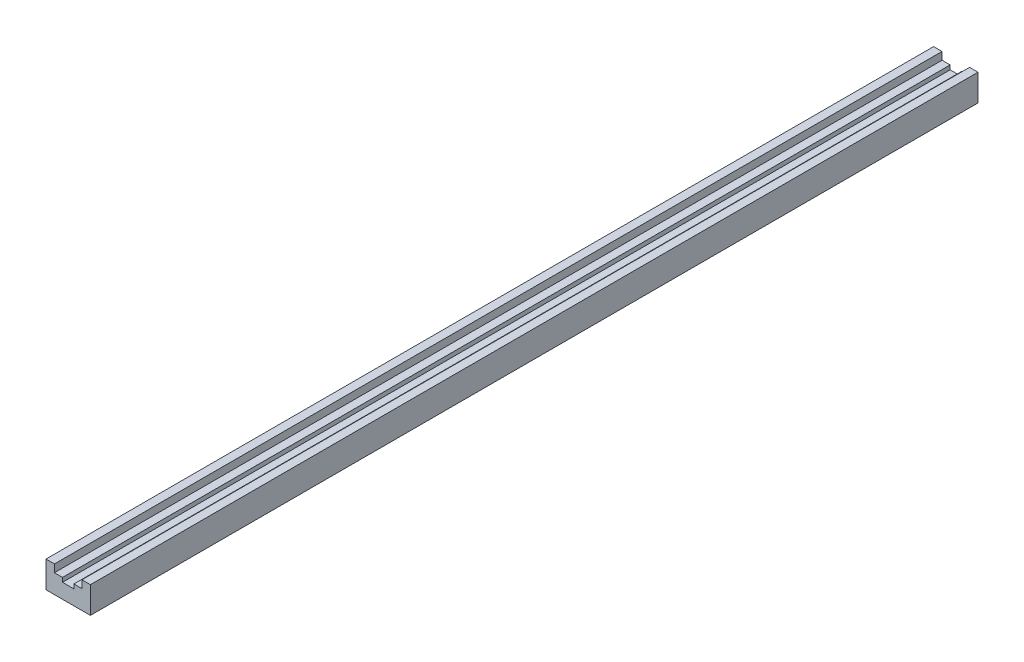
ISO-10303-21;
HEADER;
FILE_DESCRIPTION(('STEP AP214'),'2;1');
FILE_NAME('part.step','',(''),(''),'','','');
FILE_SCHEMA(('AUTOMOTIVE_DESIGN { 1 0 10303 214 1 1 1 1 }'));
ENDSEC;
DATA;
#1=APPLICATION_CONTEXT('core data for automotive mechanical design processes');
#2=APPLICATION_PROTOCOL_DEFINITION('international standard','automotive_design',2000,#1);
#3=PRODUCT_CONTEXT('',#1,'mechanical');
#4=PRODUCT('Part','Part','',(#3));
#5=PRODUCT_RELATED_PRODUCT_CATEGORY('part','',(#4));
#6=PRODUCT_DEFINITION_FORMATION('','',#4);
#7=PRODUCT_DEFINITION_CONTEXT('part definition',#1,'design');
#8=PRODUCT_DEFINITION('design','',#6,#7);
#9=PRODUCT_DEFINITION_SHAPE('','',#8);
#10=(LENGTH_UNIT() NAMED_UNIT(*) SI_UNIT(.MILLI.,.METRE.));
#11=(NAMED_UNIT(*) PLANE_ANGLE_UNIT() SI_UNIT($,.RADIAN.));
#12=(NAMED_UNIT(*) SI_UNIT($,.STERADIAN.) SOLID_ANGLE_UNIT());
#13=UNCERTAINTY_MEASURE_WITH_UNIT(LENGTH_MEASURE(1.E-05),#10,'distance_accuracy_value','');
#14=(GEOMETRIC_REPRESENTATION_CONTEXT(3) GLOBAL_UNCERTAINTY_ASSIGNED_CONTEXT((#13)) GLOBAL_UNIT_ASSIGNED_CONTEXT((#10,
#11,#12)) REPRESENTATION_CONTEXT('',''));
#15=CARTESIAN_POINT('',(0.,0.,0.));
#16=DIRECTION('',(0.,0.,1.));
#17=DIRECTION('',(1.,0.,0.));
#18=AXIS2_PLACEMENT_3D('',#15,#16,#17);
#19=CARTESIAN_POINT('',(-3.20000000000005,10.7,0.));
#20=DIRECTION('',(-1.,0.,0.));
#21=DIRECTION('',(0.,0.,1.));
#22=AXIS2_PLACEMENT_3D('',#19,#20,#21);
#23=PLANE('',#22);
#24=DIRECTION('',(0.,0.,1.));
#25=VECTOR('',#24,1.);
#26=CARTESIAN_POINT('',(-3.20000000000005,8.3,0.));
#27=LINE('',#26,#25);
#28=CARTESIAN_POINT('',(-3.20000000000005,8.3,0.));
#29=VERTEX_POINT('',#28);
#30=CARTESIAN_POINT('',(-3.20000000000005,8.3,500.));
#31=VERTEX_POINT('',#30);
#32=EDGE_CURVE('E9',#29,#31,#27,.T.);
#33=ORIENTED_EDGE('',*,*,#32,.F.);
#34=DIRECTION('',(0.,-1.,0.));
#35=VECTOR('',#34,1.);
#36=CARTESIAN_POINT('',(-3.20000000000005,10.7,0.));
#37=LINE('',#36,#35);
#38=CARTESIAN_POINT('',(-3.20000000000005,10.7,0.));
#39=VERTEX_POINT('',#38);
#40=EDGE_CURVE('E149',#39,#29,#37,.T.);
#41=ORIENTED_EDGE('',*,*,#40,.F.);
#42=DIRECTION('',(0.,0.,1.));
#43=VECTOR('',#42,1.);
#44=CARTESIAN_POINT('',(-3.20000000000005,10.7,0.));
#45=LINE('',#44,#43);
#46=CARTESIAN_POINT('',(-3.20000000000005,10.7,500.));
#47=VERTEX_POINT('',#46);
#48=EDGE_CURVE('E29',#39,#47,#45,.T.);
#49=ORIENTED_EDGE('',*,*,#48,.T.);
#50=DIRECTION('',(0.,-1.,0.));
#51=VECTOR('',#50,1.);
#52=CARTESIAN_POINT('',(-3.20000000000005,10.7,500.));
#53=LINE('',#52,#51);
#54=EDGE_CURVE('E113',#47,#31,#53,.T.);
#55=ORIENTED_EDGE('',*,*,#54,.T.);
#56=EDGE_LOOP('',(#33,#41,#49,#55));
#57=FACE_BOUND('',#56,.T.);
#58=ADVANCED_FACE('F14',(#57),#23,.F.);
#59=CARTESIAN_POINT('',(-3.20000000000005,8.3,0.));
#60=DIRECTION('',(0.,-1.,0.));
#61=DIRECTION('',(0.,0.,-1.));
#62=AXIS2_PLACEMENT_3D('',#59,#60,#61);
#63=PLANE('',#62);
#64=DIRECTION('',(0.,0.,1.));
#65=VECTOR('',#64,1.);
#66=CARTESIAN_POINT('',(3.19999999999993,8.3,0.));
#67=LINE('',#66,#65);
#68=CARTESIAN_POINT('',(3.19999999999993,8.3,0.));
#69=VERTEX_POINT('',#68);
#70=CARTESIAN_POINT('',(3.19999999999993,8.3,500.));
#71=VERTEX_POINT('',#70);
#72=EDGE_CURVE('E22',#69,#71,#67,.T.);
#73=ORIENTED_EDGE('',*,*,#72,.F.);
#74=DIRECTION('',(1.,0.,0.));
#75=VECTOR('',#74,1.);
#76=CARTESIAN_POINT('',(-3.20000000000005,8.3,0.));
#77=LINE('',#76,#75);
#78=EDGE_CURVE('E109',#29,#69,#77,.T.);
#79=ORIENTED_EDGE('',*,*,#78,.F.);
#80=ORIENTED_EDGE('',*,*,#32,.T.);
#81=DIRECTION('',(1.,0.,0.));
#82=VECTOR('',#81,1.);
#83=CARTESIAN_POINT('',(-3.20000000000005,8.3,500.));
#84=LINE('',#83,#82);
#85=EDGE_CURVE('E106',#31,#71,#84,.T.);
#86=ORIENTED_EDGE('',*,*,#85,.T.);
#87=EDGE_LOOP('',(#73,#79,#80,#86));
#88=FACE_BOUND('',#87,.T.);
#89=ADVANCED_FACE('F16',(#88),#63,.F.);
#90=CARTESIAN_POINT('',(3.20000000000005,10.7,0.));
#91=DIRECTION('',(-1.,0.,0.));
#92=DIRECTION('',(0.,-1.,0.));
#93=AXIS2_PLACEMENT_3D('',#90,#91,#92);
#94=PLANE('',#93);
#95=DIRECTION('',(0.,0.,1.));
#96=VECTOR('',#95,1.);
#97=CARTESIAN_POINT('',(3.20000000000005,10.7,0.));
#98=LINE('',#97,#96);
#99=CARTESIAN_POINT('',(3.20000000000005,10.7,0.));
#100=VERTEX_POINT('',#99);
#101=CARTESIAN_POINT('',(3.20000000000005,10.7,500.));
#102=VERTEX_POINT('',#101);
#103=EDGE_CURVE('E197',#100,#102,#98,.T.);
#104=ORIENTED_EDGE('',*,*,#103,.F.);
#105=DIRECTION('',(0.,-1.,0.));
#106=VECTOR('',#105,1.);
#107=CARTESIAN_POINT('',(3.20000000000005,10.7,0.));
#108=LINE('',#107,#106);
#109=EDGE_CURVE('E152',#100,#69,#108,.T.);
#110=ORIENTED_EDGE('',*,*,#109,.T.);
#111=ORIENTED_EDGE('',*,*,#72,.T.);
#112=DIRECTION('',(0.,-1.,0.));
#113=VECTOR('',#112,1.);
#114=CARTESIAN_POINT('',(3.20000000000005,10.7,500.));
#115=LINE('',#114,#113);
#116=EDGE_CURVE('E120',#102,#71,#115,.T.);
#117=ORIENTED_EDGE('',*,*,#116,.F.);
#118=EDGE_LOOP('',(#104,#110,#111,#117));
#119=FACE_BOUND('',#118,.T.);
#120=ADVANCED_FACE('F199',(#119),#94,.T.);
#121=CARTESIAN_POINT('',(3.20000000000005,10.7,0.));
#122=DIRECTION('',(0.,-1.,0.));
#123=DIRECTION('',(0.,0.,-1.));
#124=AXIS2_PLACEMENT_3D('',#121,#122,#123);
#125=PLANE('',#124);
#126=DIRECTION('',(0.,0.,1.));
#127=VECTOR('',#126,1.);
#128=CARTESIAN_POINT('',(7.75,10.7,0.));
#129=LINE('',#128,#127);
#130=CARTESIAN_POINT('',(7.75,10.7,0.));
#131=VERTEX_POINT('',#130);
#132=CARTESIAN_POINT('',(7.75,10.7,500.));
#133=VERTEX_POINT('',#132);
#134=EDGE_CURVE('E195',#131,#133,#129,.T.);
#135=ORIENTED_EDGE('',*,*,#134,.F.);
#136=DIRECTION('',(1.,0.,0.));
#137=VECTOR('',#136,1.);
#138=CARTESIAN_POINT('',(3.20000000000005,10.7,0.));
#139=LINE('',#138,#137);
#140=EDGE_CURVE('E155',#100,#131,#139,.T.);
#141=ORIENTED_EDGE('',*,*,#140,.F.);
#142=ORIENTED_EDGE('',*,*,#103,.T.);
#143=DIRECTION('',(1.,0.,0.));
#144=VECTOR('',#143,1.);
#145=CARTESIAN_POINT('',(3.20000000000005,10.7,500.));
#146=LINE('',#145,#144);
#147=EDGE_CURVE('E122',#102,#133,#146,.T.);
#148=ORIENTED_EDGE('',*,*,#147,.T.);
#149=EDGE_LOOP('',(#135,#141,#142,#148));
#150=FACE_BOUND('',#149,.T.);
#151=ADVANCED_FACE('F232',(#150),#125,.F.);
#152=CARTESIAN_POINT('',(7.75,15.,0.));
#153=DIRECTION('',(-1.,0.,0.));
#154=DIRECTION('',(0.,0.,1.));
#155=AXIS2_PLACEMENT_3D('',#152,#153,#154);
#156=PLANE('',#155);
#157=DIRECTION('',(0.,0.,1.));
#158=VECTOR('',#157,1.);
#159=CARTESIAN_POINT('',(7.75,15.,0.));
#160=LINE('',#159,#158);
#161=CARTESIAN_POINT('',(7.75,15.,0.));
#162=VERTEX_POINT('',#161);
#163=CARTESIAN_POINT('',(7.75,15.,500.));
#164=VERTEX_POINT('',#163);
#165=EDGE_CURVE('E193',#162,#164,#160,.T.);
#166=ORIENTED_EDGE('',*,*,#165,.F.);
#167=DIRECTION('',(0.,-1.,0.));
#168=VECTOR('',#167,1.);
#169=CARTESIAN_POINT('',(7.75,15.,0.));
#170=LINE('',#169,#168);
#171=EDGE_CURVE('E158',#162,#131,#170,.T.);
#172=ORIENTED_EDGE('',*,*,#171,.T.);
#173=ORIENTED_EDGE('',*,*,#134,.T.);
#174=DIRECTION('',(0.,-1.,0.));
#175=VECTOR('',#174,1.);
#176=CARTESIAN_POINT('',(7.75,15.,500.));
#177=LINE('',#176,#175);
#178=EDGE_CURVE('E127',#164,#133,#177,.T.);
#179=ORIENTED_EDGE('',*,*,#178,.F.);
#180=EDGE_LOOP('',(#166,#172,#173,#179));
#181=FACE_BOUND('',#180,.T.);
#182=ADVANCED_FACE('F230',(#181),#156,.T.);
#183=CARTESIAN_POINT('',(7.75,15.,0.));
#184=DIRECTION('',(0.,-1.,0.));
#185=DIRECTION('',(0.,0.,-1.));
#186=AXIS2_PLACEMENT_3D('',#183,#184,#185);
#187=PLANE('',#186);
#188=DIRECTION('',(0.,0.,1.));
#189=VECTOR('',#188,1.);
#190=CARTESIAN_POINT('',(12.5,15.,0.));
#191=LINE('',#190,#189);
#192=CARTESIAN_POINT('',(12.5,15.,0.));
#193=VERTEX_POINT('',#192);
#194=CARTESIAN_POINT('',(12.5,15.,500.));
#195=VERTEX_POINT('',#194);
#196=EDGE_CURVE('E191',#193,#195,#191,.T.);
#197=ORIENTED_EDGE('',*,*,#196,.F.);
#198=DIRECTION('',(1.,0.,0.));
#199=VECTOR('',#198,1.);
#200=CARTESIAN_POINT('',(7.75,15.,0.));
#201=LINE('',#200,#199);
#202=EDGE_CURVE('E161',#162,#193,#201,.T.);
#203=ORIENTED_EDGE('',*,*,#202,.F.);
#204=ORIENTED_EDGE('',*,*,#165,.T.);
#205=DIRECTION('',(1.,0.,0.));
#206=VECTOR('',#205,1.);
#207=CARTESIAN_POINT('',(7.75,15.,500.));
#208=LINE('',#207,#206);
#209=EDGE_CURVE('E130',#164,#195,#208,.T.);
#210=ORIENTED_EDGE('',*,*,#209,.T.);
#211=EDGE_LOOP('',(#197,#203,#204,#210));
#212=FACE_BOUND('',#211,.T.);
#213=ADVANCED_FACE('F226',(#212),#187,.F.);
#214=CARTESIAN_POINT('',(12.5,15.,0.));
#215=DIRECTION('',(-1.,0.,0.));
#216=DIRECTION('',(0.,0.,1.));
#217=AXIS2_PLACEMENT_3D('',#214,#215,#216);
#218=PLANE('',#217);
#219=DIRECTION('',(0.,0.,1.));
#220=VECTOR('',#219,1.);
#221=CARTESIAN_POINT('',(12.5,0.,0.));
#222=LINE('',#221,#220);
#223=CARTESIAN_POINT('',(12.5,0.,0.));
#224=VERTEX_POINT('',#223);
#225=CARTESIAN_POINT('',(12.5,0.,500.));
#226=VERTEX_POINT('',#225);
#227=EDGE_CURVE('E189',#224,#226,#222,.T.);
#228=ORIENTED_EDGE('',*,*,#227,.F.);
#229=DIRECTION('',(0.,-1.,0.));
#230=VECTOR('',#229,1.);
#231=CARTESIAN_POINT('',(12.5,15.,0.));
#232=LINE('',#231,#230);
#233=EDGE_CURVE('E164',#193,#224,#232,.T.);
#234=ORIENTED_EDGE('',*,*,#233,.F.);
#235=ORIENTED_EDGE('',*,*,#196,.T.);
#236=DIRECTION('',(0.,-1.,0.));
#237=VECTOR('',#236,1.);
#238=CARTESIAN_POINT('',(12.5,15.,500.));
#239=LINE('',#238,#237);
#240=EDGE_CURVE('E133',#195,#226,#239,.T.);
#241=ORIENTED_EDGE('',*,*,#240,.T.);
#242=EDGE_LOOP('',(#228,#234,#235,#241));
#243=FACE_BOUND('',#242,.T.);
#244=ADVANCED_FACE('F222',(#243),#218,.F.);
#245=CARTESIAN_POINT('',(-12.5,0.,0.));
#246=DIRECTION('',(0.,-1.,0.));
#247=DIRECTION('',(1.,0.,0.));
#248=AXIS2_PLACEMENT_3D('',#245,#246,#247);
#249=PLANE('',#248);
#250=DIRECTION('',(0.,0.,1.));
#251=VECTOR('',#250,1.);
#252=CARTESIAN_POINT('',(-12.5,0.,0.));
#253=LINE('',#252,#251);
#254=CARTESIAN_POINT('',(-12.5,0.,0.));
#255=VERTEX_POINT('',#254);
#256=CARTESIAN_POINT('',(-12.5,0.,500.));
#257=VERTEX_POINT('',#256);
#258=EDGE_CURVE('E187',#255,#257,#253,.T.);
#259=ORIENTED_EDGE('',*,*,#258,.F.);
#260=DIRECTION('',(1.,0.,0.));
#261=VECTOR('',#260,1.);
#262=CARTESIAN_POINT('',(-12.5,0.,0.));
#263=LINE('',#262,#261);
#264=EDGE_CURVE('E167',#255,#224,#263,.T.);
#265=ORIENTED_EDGE('',*,*,#264,.T.);
#266=ORIENTED_EDGE('',*,*,#227,.T.);
#267=DIRECTION('',(1.,0.,0.));
#268=VECTOR('',#267,1.);
#269=CARTESIAN_POINT('',(-12.5,0.,500.));
#270=LINE('',#269,#268);
#271=EDGE_CURVE('E136',#257,#226,#270,.T.);
#272=ORIENTED_EDGE('',*,*,#271,.F.);
#273=EDGE_LOOP('',(#259,#265,#266,#272));
#274=FACE_BOUND('',#273,.T.);
#275=ADVANCED_FACE('F218',(#274),#249,.T.);
#276=CARTESIAN_POINT('',(-12.5,15.,0.));
#277=DIRECTION('',(-1.,0.,0.));
#278=DIRECTION('',(0.,0.,1.));
#279=AXIS2_PLACEMENT_3D('',#276,#277,#278);
#280=PLANE('',#279);
#281=DIRECTION('',(0.,0.,1.));
#282=VECTOR('',#281,1.);
#283=CARTESIAN_POINT('',(-12.5,15.,0.));
#284=LINE('',#283,#282);
#285=CARTESIAN_POINT('',(-12.5,15.,0.));
#286=VERTEX_POINT('',#285);
#287=CARTESIAN_POINT('',(-12.5,15.,500.));
#288=VERTEX_POINT('',#287);
#289=EDGE_CURVE('E185',#286,#288,#284,.T.);
#290=ORIENTED_EDGE('',*,*,#289,.F.);
#291=DIRECTION('',(0.,-1.,0.));
#292=VECTOR('',#291,1.);
#293=CARTESIAN_POINT('',(-12.5,15.,0.));
#294=LINE('',#293,#292);
#295=EDGE_CURVE('E170',#286,#255,#294,.T.);
#296=ORIENTED_EDGE('',*,*,#295,.T.);
#297=ORIENTED_EDGE('',*,*,#258,.T.);
#298=DIRECTION('',(0.,-1.,0.));
#299=VECTOR('',#298,1.);
#300=CARTESIAN_POINT('',(-12.5,15.,500.));
#301=LINE('',#300,#299);
#302=EDGE_CURVE('E139',#288,#257,#301,.T.);
#303=ORIENTED_EDGE('',*,*,#302,.F.);
#304=EDGE_LOOP('',(#290,#296,#297,#303));
#305=FACE_BOUND('',#304,.T.);
#306=ADVANCED_FACE('F214',(#305),#280,.T.);
#307=CARTESIAN_POINT('',(-12.5,15.,0.));
#308=DIRECTION('',(0.,-1.,0.));
#309=DIRECTION('',(0.,0.,-1.));
#310=AXIS2_PLACEMENT_3D('',#307,#308,#309);
#311=PLANE('',#310);
#312=DIRECTION('',(0.,0.,1.));
#313=VECTOR('',#312,1.);
#314=CARTESIAN_POINT('',(-7.75,15.,0.));
#315=LINE('',#314,#313);
#316=CARTESIAN_POINT('',(-7.75,15.,0.));
#317=VERTEX_POINT('',#316);
#318=CARTESIAN_POINT('',(-7.75,15.,500.));
#319=VERTEX_POINT('',#318);
#320=EDGE_CURVE('E183',#317,#319,#315,.T.);
#321=ORIENTED_EDGE('',*,*,#320,.F.);
#322=DIRECTION('',(1.,0.,0.));
#323=VECTOR('',#322,1.);
#324=CARTESIAN_POINT('',(-12.5,15.,0.));
#325=LINE('',#324,#323);
#326=EDGE_CURVE('E173',#286,#317,#325,.T.);
#327=ORIENTED_EDGE('',*,*,#326,.F.);
#328=ORIENTED_EDGE('',*,*,#289,.T.);
#329=DIRECTION('',(1.,0.,0.));
#330=VECTOR('',#329,1.);
#331=CARTESIAN_POINT('',(-12.5,15.,500.));
#332=LINE('',#331,#330);
#333=EDGE_CURVE('E142',#288,#319,#332,.T.);
#334=ORIENTED_EDGE('',*,*,#333,.T.);
#335=EDGE_LOOP('',(#321,#327,#328,#334));
#336=FACE_BOUND('',#335,.T.);
#337=ADVANCED_FACE('F210',(#336),#311,.F.);
#338=CARTESIAN_POINT('',(-7.75,15.,0.));
#339=DIRECTION('',(-1.,0.,0.));
#340=DIRECTION('',(0.,0.,1.));
#341=AXIS2_PLACEMENT_3D('',#338,#339,#340);
#342=PLANE('',#341);
#343=DIRECTION('',(0.,0.,1.));
#344=VECTOR('',#343,1.);
#345=CARTESIAN_POINT('',(-7.75,10.7,0.));
#346=LINE('',#345,#344);
#347=CARTESIAN_POINT('',(-7.75,10.7,0.));
#348=VERTEX_POINT('',#347);
#349=CARTESIAN_POINT('',(-7.75,10.7,500.));
#350=VERTEX_POINT('',#349);
#351=EDGE_CURVE('E37',#348,#350,#346,.T.);
#352=ORIENTED_EDGE('',*,*,#351,.F.);
#353=DIRECTION('',(0.,-1.,0.));
#354=VECTOR('',#353,1.);
#355=CARTESIAN_POINT('',(-7.75,15.,0.));
#356=LINE('',#355,#354);
#357=EDGE_CURVE('E176',#317,#348,#356,.T.);
#358=ORIENTED_EDGE('',*,*,#357,.F.);
#359=ORIENTED_EDGE('',*,*,#320,.T.);
#360=DIRECTION('',(0.,-1.,0.));
#361=VECTOR('',#360,1.);
#362=CARTESIAN_POINT('',(-7.75,15.,500.));
#363=LINE('',#362,#361);
#364=EDGE_CURVE('E145',#319,#350,#363,.T.);
#365=ORIENTED_EDGE('',*,*,#364,.T.);
#366=EDGE_LOOP('',(#352,#358,#359,#365));
#367=FACE_BOUND('',#366,.T.);
#368=ADVANCED_FACE('F206',(#367),#342,.F.);
#369=CARTESIAN_POINT('',(-7.75,10.7,0.));
#370=DIRECTION('',(0.,-1.,0.));
#371=DIRECTION('',(1.,0.,0.));
#372=AXIS2_PLACEMENT_3D('',#369,#370,#371);
#373=PLANE('',#372);
#374=DIRECTION('',(1.,0.,0.));
#375=VECTOR('',#374,1.);
#376=CARTESIAN_POINT('',(-7.75,10.7,0.));
#377=LINE('',#376,#375);
#378=EDGE_CURVE('E178',#348,#39,#377,.T.);
#379=ORIENTED_EDGE('',*,*,#378,.F.);
#380=ORIENTED_EDGE('',*,*,#351,.T.);
#381=DIRECTION('',(1.,0.,0.));
#382=VECTOR('',#381,1.);
#383=CARTESIAN_POINT('',(-7.75,10.7,500.));
#384=LINE('',#383,#382);
#385=EDGE_CURVE('E147',#350,#47,#384,.T.);
#386=ORIENTED_EDGE('',*,*,#385,.T.);
#387=ORIENTED_EDGE('',*,*,#48,.F.);
#388=EDGE_LOOP('',(#379,#380,#386,#387));
#389=FACE_BOUND('',#388,.T.);
#390=ADVANCED_FACE('F204',(#389),#373,.F.);
#391=CARTESIAN_POINT('',(-3.20000000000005,8.3,0.));
#392=DIRECTION('',(0.,0.,1.));
#393=DIRECTION('',(1.,0.,0.));
#394=AXIS2_PLACEMENT_3D('',#391,#392,#393);
#395=PLANE('',#394);
#396=ORIENTED_EDGE('',*,*,#40,.T.);
#397=ORIENTED_EDGE('',*,*,#78,.T.);
#398=ORIENTED_EDGE('',*,*,#109,.F.);
#399=ORIENTED_EDGE('',*,*,#140,.T.);
#400=ORIENTED_EDGE('',*,*,#171,.F.);
#401=ORIENTED_EDGE('',*,*,#202,.T.);
#402=ORIENTED_EDGE('',*,*,#233,.T.);
#403=ORIENTED_EDGE('',*,*,#264,.F.);
#404=ORIENTED_EDGE('',*,*,#295,.F.);
#405=ORIENTED_EDGE('',*,*,#326,.T.);
#406=ORIENTED_EDGE('',*,*,#357,.T.);
#407=ORIENTED_EDGE('',*,*,#378,.T.);
#408=EDGE_LOOP('',(#396,#397,#398,#399,#400,#401,#402,#403,#404,#405,#406,#407));
#409=FACE_BOUND('',#408,.T.);
#410=ADVANCED_FACE('F202',(#409),#395,.F.);
#411=CARTESIAN_POINT('',(-3.20000000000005,8.3,500.));
#412=DIRECTION('',(0.,0.,1.));
#413=DIRECTION('',(1.,0.,0.));
#414=AXIS2_PLACEMENT_3D('',#411,#412,#413);
#415=PLANE('',#414);
#416=ORIENTED_EDGE('',*,*,#54,.F.);
#417=ORIENTED_EDGE('',*,*,#385,.F.);
#418=ORIENTED_EDGE('',*,*,#364,.F.);
#419=ORIENTED_EDGE('',*,*,#333,.F.);
#420=ORIENTED_EDGE('',*,*,#302,.T.);
#421=ORIENTED_EDGE('',*,*,#271,.T.);
#422=ORIENTED_EDGE('',*,*,#240,.F.);
#423=ORIENTED_EDGE('',*,*,#209,.F.);
#424=ORIENTED_EDGE('',*,*,#178,.T.);
#425=ORIENTED_EDGE('',*,*,#147,.F.);
#426=ORIENTED_EDGE('',*,*,#116,.T.);
#427=ORIENTED_EDGE('',*,*,#85,.F.);
#428=EDGE_LOOP('',(#416,#417,#418,#419,#420,#421,#422,#423,#424,#425,#426,#427));
#429=FACE_BOUND('',#428,.T.);
#430=ADVANCED_FACE('F117',(#429),#415,.T.);
#431=CLOSED_SHELL('',(#58,#89,#120,#151,#182,#213,#244,#275,#306,#337,#368,#390,#410,#430));
#432=MANIFOLD_SOLID_BREP('B1',#431);
#433=ADVANCED_BREP_SHAPE_REPRESENTATION('',(#18,#432),#14);
#434=SHAPE_DEFINITION_REPRESENTATION(#9,#433);
ENDSEC;
END-ISO-10303-21;
